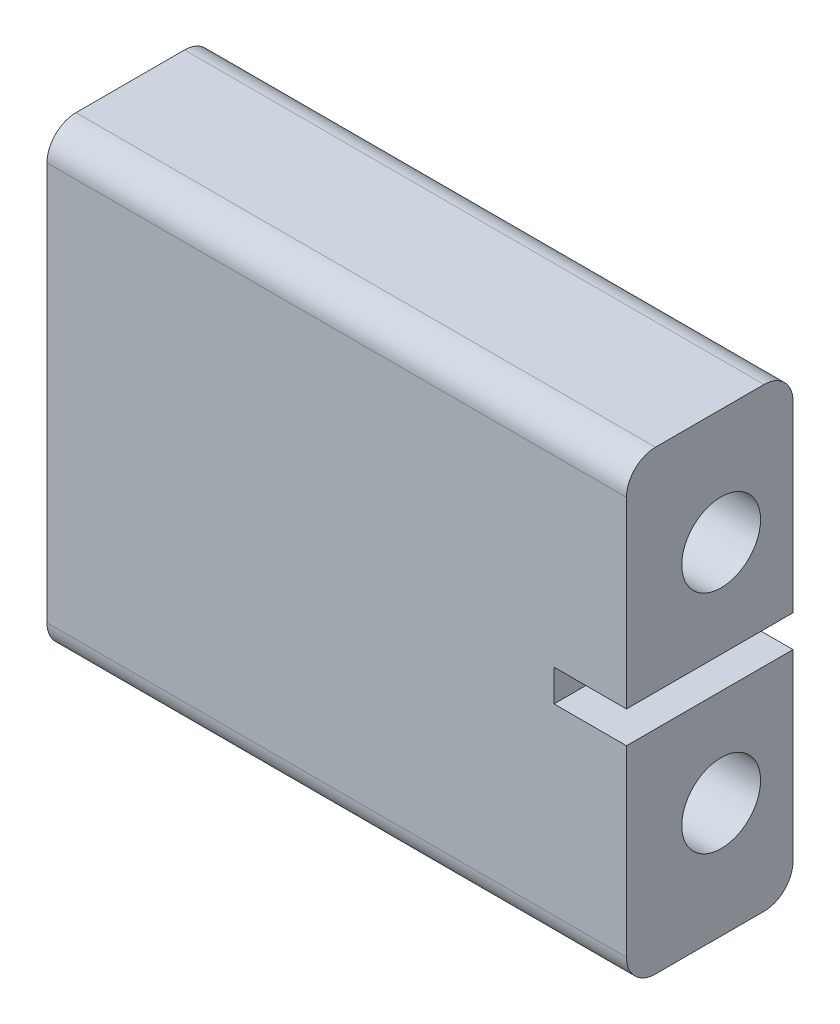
from build123d import *

# Parameters (mm, degrees)
SKETCH1_W           = 7.3
SKETCH1_H           = 19.99999
SKETCH1_R           = 1.7272
BOSS_EXTRUDE1_DEPTH = 25.4
SKETCH2_W           = 7.3
SKETCH2_H           = 1.397
CUT_EXTRUDE1_DEPTH  = 3.175
FILLET1_R           = 1.27


with BuildPart() as part:
    # Sketch1 → Boss-Extrude1 (new body)
    with BuildSketch(Plane(origin=(0, 0, 0), x_dir=(0, 0, -1), z_dir=(1, 0, 0))):
        with Locations((23.094, 11.638999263)):
            Rectangle(SKETCH1_W, SKETCH1_H)
        with Locations((23.594, 16.588996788)):
            Circle(SKETCH1_R, mode=Mode.SUBTRACT)
        with Locations((23.594, 6.689001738)):
            Circle(SKETCH1_R, mode=Mode.SUBTRACT)
    extrude(amount=BOSS_EXTRUDE1_DEPTH)

    # Sketch2 → Cut-Extrude1 (cut)
    with BuildSketch(Plane(origin=(25.4, 0, 0), x_dir=(0, 0, -1), z_dir=(1, 0, 0))):
        with Locations((23.094, 11.638999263)):
            Rectangle(SKETCH2_W, SKETCH2_H)
    extrude(amount=-CUT_EXTRUDE1_DEPTH, mode=Mode.SUBTRACT)

    # Fillet1
    fillet1_edges = [part.edges().sort_by_distance(p)[0] for p in [
        (12.7, 1.639004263, -26.744),
        (12.7, 1.639004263, -19.444),
        (12.7, 21.638994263, -19.444),
        (12.7, 21.638994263, -26.744),
    ]]
    fillet(fillet1_edges, radius=FILLET1_R)


solid = part.part
